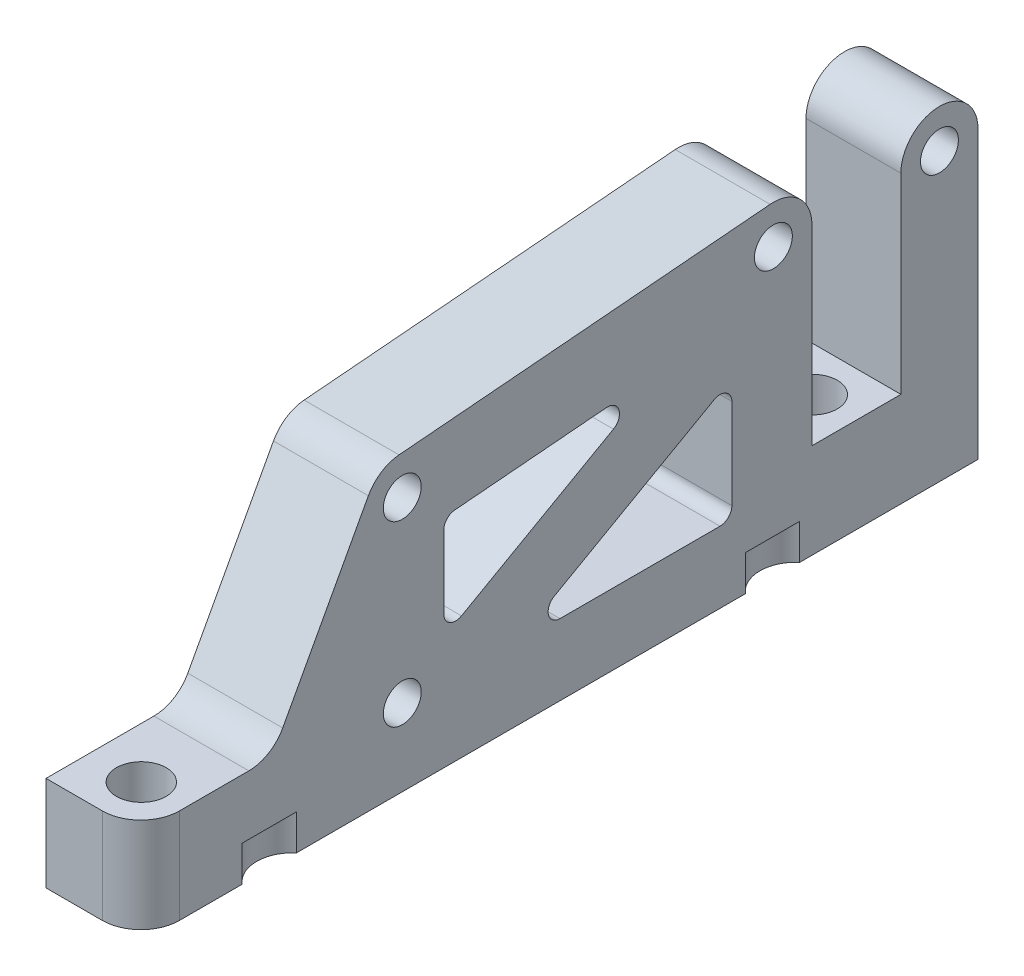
from build123d import *

# Parameters (mm, degrees)
SKETCH_1_R          = 1.6
EXTRUDE_1_DEPTH     = 8
SKETCH_2_R          = 2.1
CUT_EXTRUDE_1_DEPTH = 724.262226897
CUT_EXTRUDE_START   = -5
SKETCH_3_R          = 3
CUT_EXTRUDE_2_DEPTH = 719.003353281
FILLET_1_R          = 3.25
FILLET_2_R          = 3.25
CUT_EXTRUDE_3_DEPTH = 737.180038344
FILLET_3_R          = 1
SKETCH_5_W          = 80.568542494
SKETCH_5_H          = 34.15
CUT_EXTRUDE_4_DEPTH = 10


with BuildPart() as part:
    # Sketch 1 → Extrude 1 (new body)
    with BuildSketch(Plane.ZY.offset(24)):
        with BuildLine():
            Line((668.99004445, 143.388402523), (702.023150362, 140.590263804))
            Line((702.023150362, 140.590263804), (711, 124))
            Line((711, 124), (722.034271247, 124))
            Line((722.034271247, 124), (722.034271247, 116))
            Line((722.034271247, 116), (651.465728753, 116))
            Line((651.465728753, 116), (651.465728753, 140.15))
            ThreePointArc((651.465728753, 140.15), (654.715728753, 143.4), (657.965728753, 140.15))
            Line((657.965728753, 140.15), (657.965728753, 124))
            Line((657.965728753, 124), (665.465728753, 124))
            Line((665.465728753, 124), (665.465728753, 140.15))
            ThreePointArc((665.465728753, 140.15), (666.516754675, 142.543117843), (668.99004445, 143.388402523))
        make_face()
        with Locations((654.715728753, 140.15)):
            Circle(SKETCH_1_R, mode=Mode.SUBTRACT)
        with Locations((668.715728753, 140.15)):
            Circle(SKETCH_1_R, mode=Mode.SUBTRACT)
        with Locations((700, 137.5)):
            Circle(SKETCH_1_R, mode=Mode.SUBTRACT)
        with Locations((700, 122.5)):
            Circle(SKETCH_1_R, mode=Mode.SUBTRACT)
    extrude(amount=EXTRUDE_1_DEPTH)

    # Sketch 2 → Cut-Extrude 1 (cut, through all)
    with BuildSketch(Plane.XZ.offset(-116)):
        with Locations(Location((-28.284271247, 718.284271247, 0), (0, 0, 270))):
            Circle(SKETCH_2_R)
        with Locations(Location((-28.284271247, 661.715728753, 0), (0, 0, 270))):
            Circle(SKETCH_2_R)
    extrude(amount=-CUT_EXTRUDE_1_DEPTH, mode=Mode.SUBTRACT)

    # Sketch 3 → Cut-Extrude 2 (cut, through all)
    with BuildSketch(Plane(origin=(0, 124, 0), x_dir=(1, 0, 0), z_dir=(0, 1, 0)).offset(CUT_EXTRUDE_START)):
        with Locations((-33.941125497, -668.786796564)):
            Circle(SKETCH_3_R)
        with Locations((-33.941125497, -711.213203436)):
            Circle(SKETCH_3_R)
    extrude(amount=-CUT_EXTRUDE_2_DEPTH, mode=Mode.SUBTRACT)

    # Fillet 1
    fillet_1_edges = [part.edges().sort_by_distance(p)[0] for p in [
        (-28, 140.590263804, 702.023150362),
        (-28, 124, 711),
    ]]
    fillet(fillet_1_edges, radius=FILLET_1_R)

    # Fillet 2
    fillet_2_edges = [part.edges().sort_by_distance(p)[0] for p in [
        (-32, 120, 722.034271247),
    ]]
    fillet(fillet_2_edges, radius=FILLET_2_R)

    # Sketch 4 → Cut-Extrude 3 (cut, through all)
    with BuildSketch(Plane.ZY.offset(32)):
        Polygon((678.203122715, 135.833816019), (696.5, 134.283940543), (696.5, 125.511060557), align=None)
        Polygon((672.215728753, 132.322755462), (690.512606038, 122), (672.215728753, 122), align=None)
    extrude(amount=-CUT_EXTRUDE_3_DEPTH, mode=Mode.SUBTRACT)

    # Fillet 3
    fillet_3_edges = [part.edges().sort_by_distance(p)[0] for p in [
        (-28, 122, 672.215728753),
        (-28, 132.322755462, 672.215728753),
        (-28, 122, 690.512606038),
        (-28, 125.511060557, 696.5),
        (-28, 135.833816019, 678.203122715),
        (-28, 134.283940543, 696.5),
    ]]
    fillet(fillet_3_edges, radius=FILLET_3_R)


with BuildPart() as body_2:
    # Mirror 1: mirrored copy
    add(part.part.mirror(Plane(origin=(0, 0, 0), x_dir=(0, 0, 1), z_dir=(1, 0, 0))))


with BuildPart() as part_1:
    add(part.part)

    # Sketch 5 → Cut-Extrude 4 (cut)
    with BuildSketch(Plane.ZY.offset(32)):
        with Locations((686.75, 128.075)):
            Rectangle(SKETCH_5_W, SKETCH_5_H)
    extrude(amount=-CUT_EXTRUDE_4_DEPTH, mode=Mode.SUBTRACT)


solid = body_2.part
